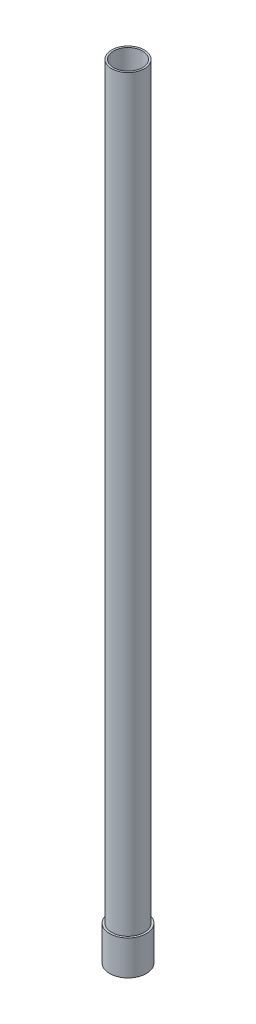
ISO-10303-21;
HEADER;
FILE_DESCRIPTION(('STEP AP214'),'2;1');
FILE_NAME('part.step','',(''),(''),'','','');
FILE_SCHEMA(('AUTOMOTIVE_DESIGN { 1 0 10303 214 1 1 1 1 }'));
ENDSEC;
DATA;
#1=APPLICATION_CONTEXT('core data for automotive mechanical design processes');
#2=APPLICATION_PROTOCOL_DEFINITION('international standard','automotive_design',2000,#1);
#3=PRODUCT_CONTEXT('',#1,'mechanical');
#4=PRODUCT('Part','Part','',(#3));
#5=PRODUCT_RELATED_PRODUCT_CATEGORY('part','',(#4));
#6=PRODUCT_DEFINITION_FORMATION('','',#4);
#7=PRODUCT_DEFINITION_CONTEXT('part definition',#1,'design');
#8=PRODUCT_DEFINITION('design','',#6,#7);
#9=PRODUCT_DEFINITION_SHAPE('','',#8);
#10=(LENGTH_UNIT() NAMED_UNIT(*) SI_UNIT(.MILLI.,.METRE.));
#11=(NAMED_UNIT(*) PLANE_ANGLE_UNIT() SI_UNIT($,.RADIAN.));
#12=(NAMED_UNIT(*) SI_UNIT($,.STERADIAN.) SOLID_ANGLE_UNIT());
#13=UNCERTAINTY_MEASURE_WITH_UNIT(LENGTH_MEASURE(1.E-05),#10,'distance_accuracy_value','');
#14=(GEOMETRIC_REPRESENTATION_CONTEXT(3) GLOBAL_UNCERTAINTY_ASSIGNED_CONTEXT((#13)) GLOBAL_UNIT_ASSIGNED_CONTEXT((#10,
#11,#12)) REPRESENTATION_CONTEXT('',''));
#15=CARTESIAN_POINT('',(0.,0.,0.));
#16=DIRECTION('',(0.,0.,1.));
#17=DIRECTION('',(1.,0.,0.));
#18=AXIS2_PLACEMENT_3D('',#15,#16,#17);
#19=CARTESIAN_POINT('',(0.,0.,0.));
#20=DIRECTION('',(0.,-1.,0.));
#21=DIRECTION('',(0.,0.,-1.));
#22=AXIS2_PLACEMENT_3D('',#19,#20,#21);
#23=CYLINDRICAL_SURFACE('',#22,5.6388);
#24=CARTESIAN_POINT('',(0.,304.8,0.));
#25=DIRECTION('',(0.,-1.,0.));
#26=DIRECTION('',(0.,0.,-1.));
#27=AXIS2_PLACEMENT_3D('',#24,#25,#26);
#28=CIRCLE('',#27,5.6388);
#29=CARTESIAN_POINT('',(0.,304.8,-5.6388));
#30=VERTEX_POINT('',#29);
#31=EDGE_CURVE('E52',#30,#30,#28,.T.);
#32=ORIENTED_EDGE('',*,*,#31,.F.);
#33=EDGE_LOOP('',(#32));
#34=FACE_BOUND('',#33,.T.);
#35=CARTESIAN_POINT('',(0.,0.,0.));
#36=DIRECTION('',(0.,-1.,0.));
#37=DIRECTION('',(0.,0.,-1.));
#38=AXIS2_PLACEMENT_3D('',#35,#36,#37);
#39=CIRCLE('',#38,5.6388);
#40=CARTESIAN_POINT('',(0.,0.,-5.6388));
#41=VERTEX_POINT('',#40);
#42=EDGE_CURVE('E10',#41,#41,#39,.T.);
#43=ORIENTED_EDGE('',*,*,#42,.T.);
#44=EDGE_LOOP('',(#43));
#45=FACE_BOUND('',#44,.T.);
#46=ADVANCED_FACE('F30',(#34,#45),#23,.F.);
#47=CARTESIAN_POINT('',(-5.6388,0.,0.));
#48=DIRECTION('',(0.,1.,0.));
#49=DIRECTION('',(0.,0.,1.));
#50=AXIS2_PLACEMENT_3D('',#47,#48,#49);
#51=PLANE('',#50);
#52=ORIENTED_EDGE('',*,*,#42,.F.);
#53=EDGE_LOOP('',(#52));
#54=FACE_BOUND('',#53,.T.);
#55=CARTESIAN_POINT('',(0.,0.,0.));
#56=DIRECTION('',(0.,-1.,0.));
#57=DIRECTION('',(0.,0.,-1.));
#58=AXIS2_PLACEMENT_3D('',#55,#56,#57);
#59=CIRCLE('',#58,7.14375);
#60=CARTESIAN_POINT('',(0.,0.,-7.14375));
#61=VERTEX_POINT('',#60);
#62=EDGE_CURVE('E36',#61,#61,#59,.T.);
#63=ORIENTED_EDGE('',*,*,#62,.T.);
#64=EDGE_LOOP('',(#63));
#65=FACE_BOUND('',#64,.T.);
#66=ADVANCED_FACE('F59',(#54,#65),#51,.F.);
#67=CARTESIAN_POINT('',(0.,0.,0.));
#68=DIRECTION('',(0.,-1.,0.));
#69=DIRECTION('',(0.,0.,-1.));
#70=AXIS2_PLACEMENT_3D('',#67,#68,#69);
#71=CYLINDRICAL_SURFACE('',#70,7.14375);
#72=ORIENTED_EDGE('',*,*,#62,.F.);
#73=EDGE_LOOP('',(#72));
#74=FACE_BOUND('',#73,.T.);
#75=CARTESIAN_POINT('',(0.,13.4874,0.));
#76=DIRECTION('',(0.,-1.,0.));
#77=DIRECTION('',(0.,0.,-1.));
#78=AXIS2_PLACEMENT_3D('',#75,#76,#77);
#79=CIRCLE('',#78,7.14375);
#80=CARTESIAN_POINT('',(0.,13.4874,-7.14375));
#81=VERTEX_POINT('',#80);
#82=EDGE_CURVE('E40',#81,#81,#79,.T.);
#83=ORIENTED_EDGE('',*,*,#82,.T.);
#84=EDGE_LOOP('',(#83));
#85=FACE_BOUND('',#84,.T.);
#86=ADVANCED_FACE('F63',(#74,#85),#71,.T.);
#87=CARTESIAN_POINT('',(-7.14375,13.4874,0.));
#88=DIRECTION('',(0.,-1.,0.));
#89=DIRECTION('',(0.,0.,-1.));
#90=AXIS2_PLACEMENT_3D('',#87,#88,#89);
#91=PLANE('',#90);
#92=ORIENTED_EDGE('',*,*,#82,.F.);
#93=EDGE_LOOP('',(#92));
#94=FACE_BOUND('',#93,.T.);
#95=CARTESIAN_POINT('',(0.,13.4874,0.));
#96=DIRECTION('',(0.,-1.,0.));
#97=DIRECTION('',(0.,0.,-1.));
#98=AXIS2_PLACEMENT_3D('',#95,#96,#97);
#99=CIRCLE('',#98,6.35);
#100=CARTESIAN_POINT('',(0.,13.4874,-6.35));
#101=VERTEX_POINT('',#100);
#102=EDGE_CURVE('E44',#101,#101,#99,.T.);
#103=ORIENTED_EDGE('',*,*,#102,.T.);
#104=EDGE_LOOP('',(#103));
#105=FACE_BOUND('',#104,.T.);
#106=ADVANCED_FACE('F68',(#94,#105),#91,.F.);
#107=CARTESIAN_POINT('',(0.,0.,0.));
#108=DIRECTION('',(0.,-1.,0.));
#109=DIRECTION('',(0.,0.,-1.));
#110=AXIS2_PLACEMENT_3D('',#107,#108,#109);
#111=CYLINDRICAL_SURFACE('',#110,6.35);
#112=ORIENTED_EDGE('',*,*,#102,.F.);
#113=EDGE_LOOP('',(#112));
#114=FACE_BOUND('',#113,.T.);
#115=CARTESIAN_POINT('',(0.,304.8,0.));
#116=DIRECTION('',(0.,-1.,0.));
#117=DIRECTION('',(0.,0.,-1.));
#118=AXIS2_PLACEMENT_3D('',#115,#116,#117);
#119=CIRCLE('',#118,6.35);
#120=CARTESIAN_POINT('',(0.,304.8,-6.35));
#121=VERTEX_POINT('',#120);
#122=EDGE_CURVE('E49',#121,#121,#119,.T.);
#123=ORIENTED_EDGE('',*,*,#122,.T.);
#124=EDGE_LOOP('',(#123));
#125=FACE_BOUND('',#124,.T.);
#126=ADVANCED_FACE('F74',(#114,#125),#111,.T.);
#127=CARTESIAN_POINT('',(-6.35,304.8,0.));
#128=DIRECTION('',(0.,-1.,0.));
#129=DIRECTION('',(0.,0.,-1.));
#130=AXIS2_PLACEMENT_3D('',#127,#128,#129);
#131=PLANE('',#130);
#132=ORIENTED_EDGE('',*,*,#122,.F.);
#133=EDGE_LOOP('',(#132));
#134=FACE_BOUND('',#133,.T.);
#135=ORIENTED_EDGE('',*,*,#31,.T.);
#136=EDGE_LOOP('',(#135));
#137=FACE_BOUND('',#136,.T.);
#138=ADVANCED_FACE('F56',(#134,#137),#131,.F.);
#139=CLOSED_SHELL('',(#46,#66,#86,#106,#126,#138));
#140=MANIFOLD_SOLID_BREP('B2',#139);
#141=ADVANCED_BREP_SHAPE_REPRESENTATION('',(#18,#140),#14);
#142=SHAPE_DEFINITION_REPRESENTATION(#9,#141);
ENDSEC;
END-ISO-10303-21;
